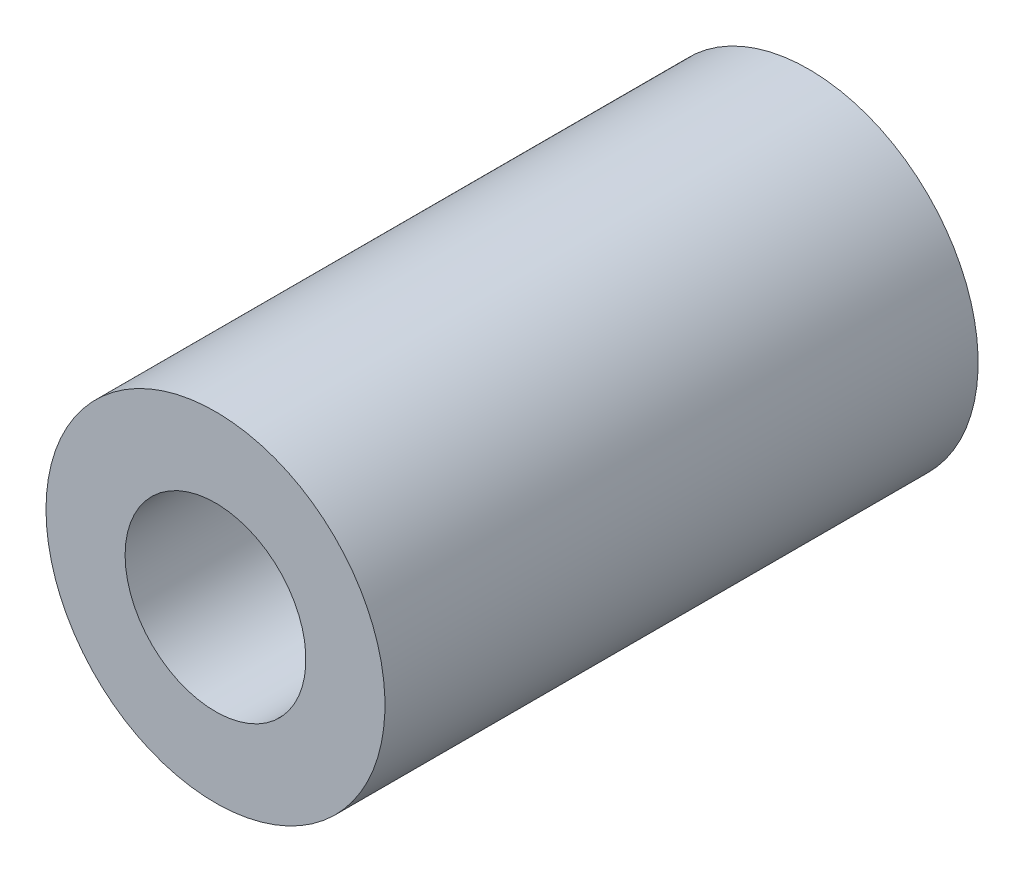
from build123d import *

# Parameters (mm, degrees)
ESQUISSE1_R        = 3
ESQUISSE1_R_2      = 1.6
BOSS_EXTRU_1_DEPTH = 10.5


with BuildPart() as part:
    # Esquisse1 → Boss.-Extru.1 (new body)
    with BuildSketch(Plane.XY):
        with Locations(Location((0, 0, 0), (0, 0, 180))):
            Circle(ESQUISSE1_R)
        with Locations(Location((0, 0, 0), (0, 0, 180))):
            Circle(ESQUISSE1_R_2, mode=Mode.SUBTRACT)
    extrude(amount=BOSS_EXTRU_1_DEPTH)


solid = part.part
